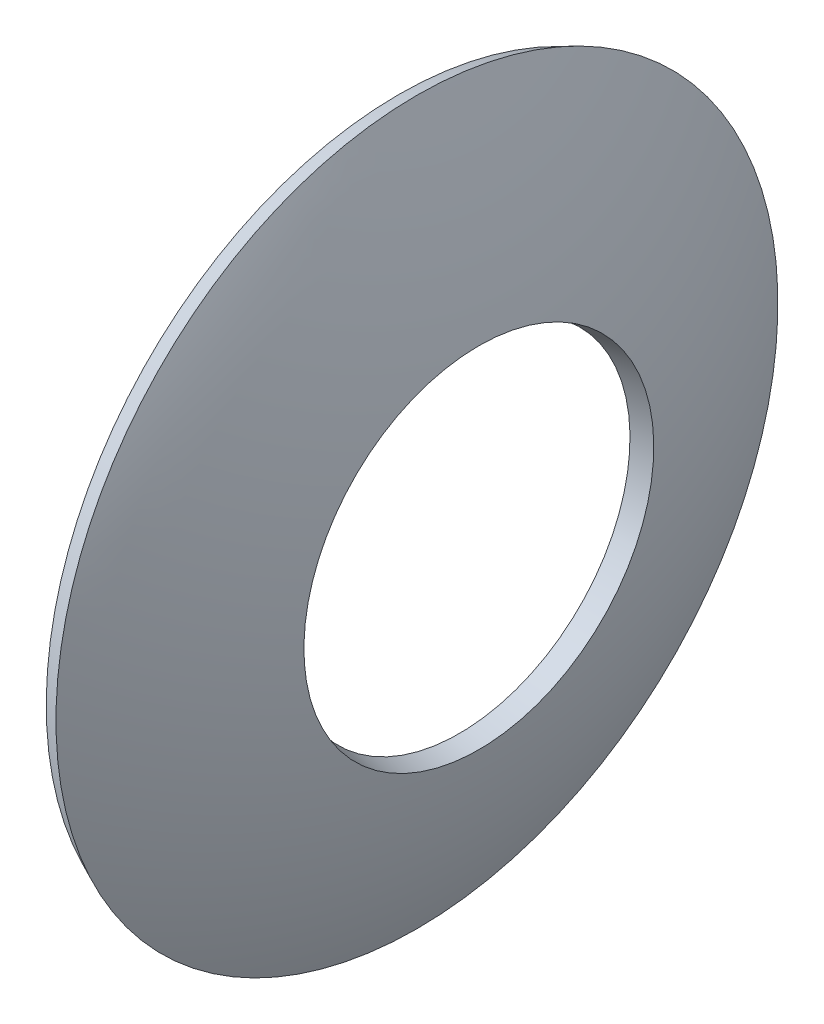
from build123d import *


with BuildPart() as part:
    # Esquisse1 → R_vol.-Mince1 (revolve)
    with BuildSketch(Plane.XY):
        with BuildLine():
            ThreePointArc((40.620192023, 8.5), (39.376191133, 13.105936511), (37.611773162, 17.538657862))
            Line((37.611773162, 17.538657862), (38.518080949, 17.961276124))
            ThreePointArc((38.518080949, 17.961276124), (40.325015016, 13.42174221), (41.598991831, 8.704819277))
            Line((41.598991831, 8.704819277), (40.620192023, 8.5))
        make_face()
    revolve(axis=Axis((0, 0, 0), (1, 0, 0)))


solid = part.part
